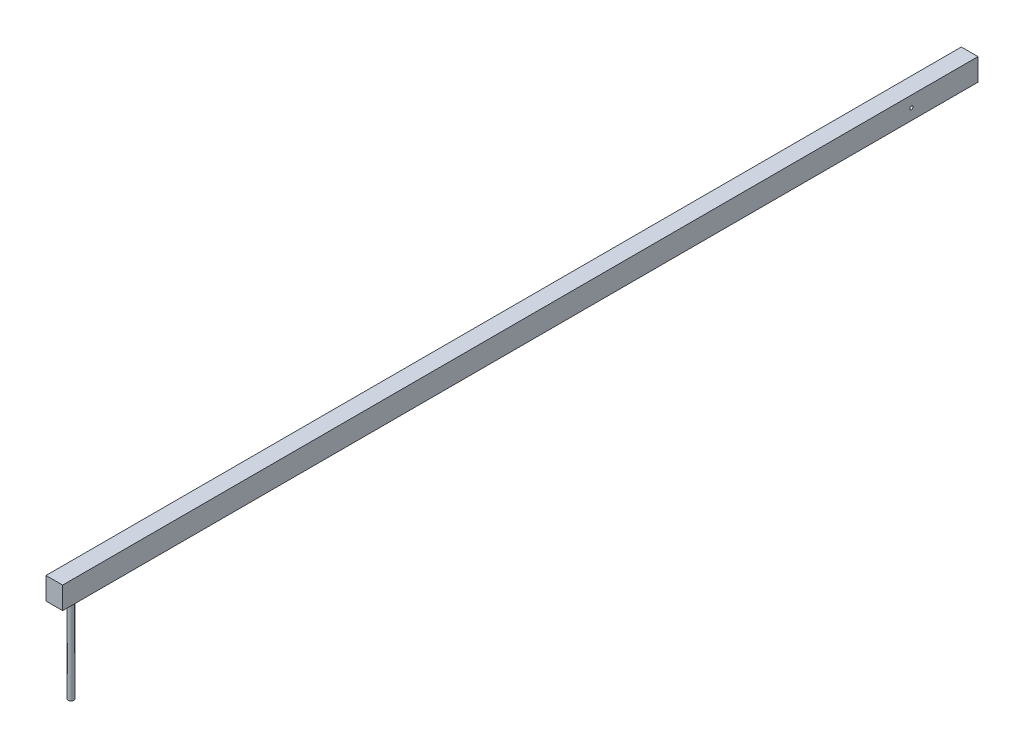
from build123d import *

# Parameters (mm, degrees)
ESQUISSE1_W                  = 30
ESQUISSE1_H                  = 40
BOSS_EXTRU_1_DEPTH           = 825
ESQUISSE2_R                  = 5
BOSS_EXTRU_2_DEPTH           = 200
ENL_V_MAT_EXTRU_1_DEPTH      = 845.94082633
ENL_V_MAT_EXTRU_1_DEPTH_BACK = 845.94082633
ESQUISSE3_R                  = 3


with BuildPart() as part:
    # Esquisse1 → Boss.-Extru.1 (new, symmetric)
    with BuildSketch(Plane.XY):
        Rectangle(ESQUISSE1_W, ESQUISSE1_H)
    extrude(amount=BOSS_EXTRU_1_DEPTH, both=True)

    # Esquisse2 → Boss.-Extru.2 (add)
    with BuildSketch(Plane(origin=(0, 20, 0), x_dir=(1, 0, 0), z_dir=(0, 1, 0))):
        with Locations(Location((0, -795, 0), (0, 0, 270))):
            Circle(ESQUISSE2_R)
    extrude(amount=-BOSS_EXTRU_2_DEPTH)

    # Esquisse3 → Enl_v. mat.-Extru.1 (cut, two sides: drawn at the far end of the back side and taken through both)
    with BuildSketch(Plane.ZY.offset(15).offset(-ENL_V_MAT_EXTRU_1_DEPTH_BACK)):
        with Locations((-705, 0)):
            Circle(ESQUISSE3_R)
    extrude(amount=ENL_V_MAT_EXTRU_1_DEPTH + ENL_V_MAT_EXTRU_1_DEPTH_BACK, mode=Mode.SUBTRACT)


solid = part.part
